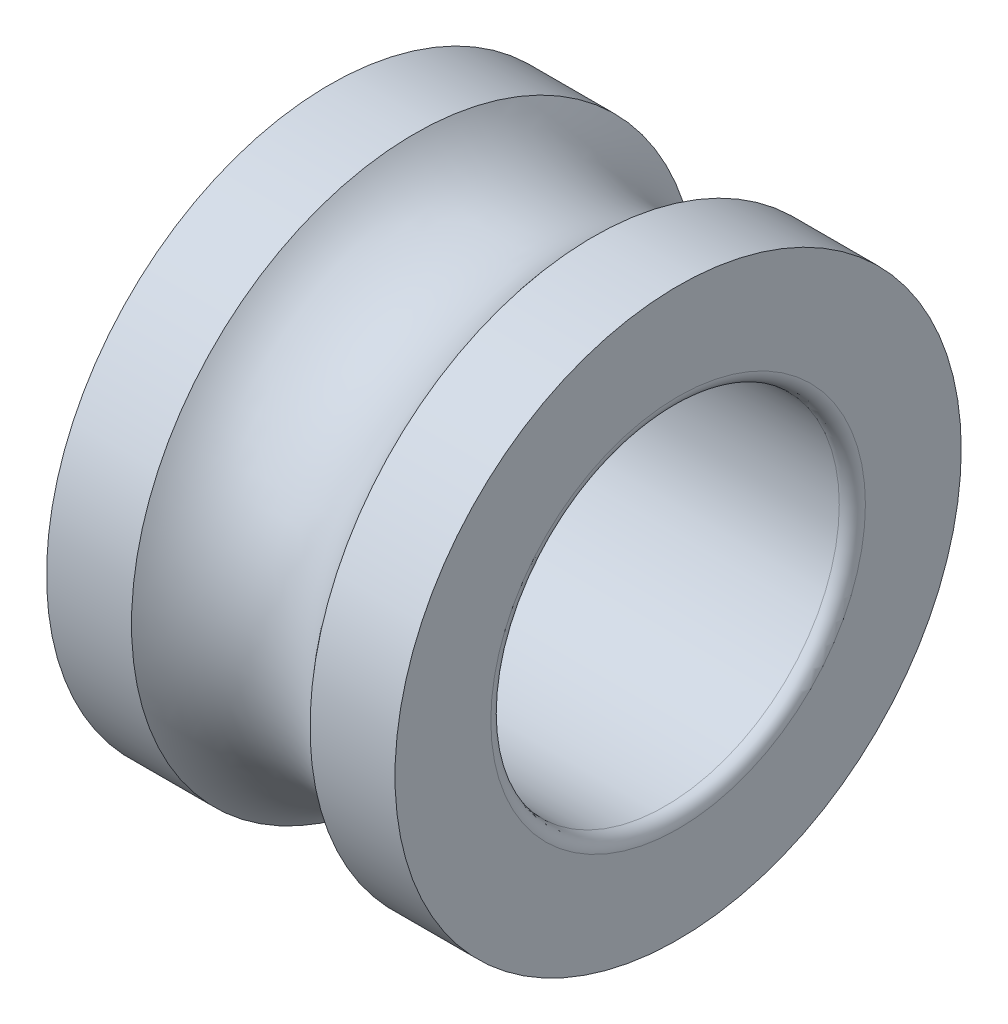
ISO-10303-21;
HEADER;
FILE_DESCRIPTION(('STEP AP214'),'2;1');
FILE_NAME('part.step','',(''),(''),'','','');
FILE_SCHEMA(('AUTOMOTIVE_DESIGN { 1 0 10303 214 1 1 1 1 }'));
ENDSEC;
DATA;
#1=APPLICATION_CONTEXT('core data for automotive mechanical design processes');
#2=APPLICATION_PROTOCOL_DEFINITION('international standard','automotive_design',2000,#1);
#3=PRODUCT_CONTEXT('',#1,'mechanical');
#4=PRODUCT('Part','Part','',(#3));
#5=PRODUCT_RELATED_PRODUCT_CATEGORY('part','',(#4));
#6=PRODUCT_DEFINITION_FORMATION('','',#4);
#7=PRODUCT_DEFINITION_CONTEXT('part definition',#1,'design');
#8=PRODUCT_DEFINITION('design','',#6,#7);
#9=PRODUCT_DEFINITION_SHAPE('','',#8);
#10=(LENGTH_UNIT() NAMED_UNIT(*) SI_UNIT(.MILLI.,.METRE.));
#11=(NAMED_UNIT(*) PLANE_ANGLE_UNIT() SI_UNIT($,.RADIAN.));
#12=(NAMED_UNIT(*) SI_UNIT($,.STERADIAN.) SOLID_ANGLE_UNIT());
#13=UNCERTAINTY_MEASURE_WITH_UNIT(LENGTH_MEASURE(1.E-05),#10,'distance_accuracy_value','');
#14=(GEOMETRIC_REPRESENTATION_CONTEXT(3) GLOBAL_UNCERTAINTY_ASSIGNED_CONTEXT((#13)) GLOBAL_UNIT_ASSIGNED_CONTEXT((#10,
#11,#12)) REPRESENTATION_CONTEXT('',''));
#15=CARTESIAN_POINT('',(0.,0.,0.));
#16=DIRECTION('',(0.,0.,1.));
#17=DIRECTION('',(1.,0.,0.));
#18=AXIS2_PLACEMENT_3D('',#15,#16,#17);
#19=CARTESIAN_POINT('',(-4.,6.5,0.));
#20=DIRECTION('',(-1.,0.,0.));
#21=DIRECTION('',(0.,0.,1.));
#22=AXIS2_PLACEMENT_3D('',#19,#20,#21);
#23=PLANE('',#22);
#24=CARTESIAN_POINT('',(-4.,0.,0.));
#25=DIRECTION('',(1.,0.,0.));
#26=DIRECTION('',(0.,0.,-1.));
#27=AXIS2_PLACEMENT_3D('',#24,#25,#26);
#28=CIRCLE('',#27,4.30000003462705);
#29=CARTESIAN_POINT('',(-4.,0.,-4.30000003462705));
#30=VERTEX_POINT('',#29);
#31=EDGE_CURVE('E5',#30,#30,#28,.T.);
#32=ORIENTED_EDGE('',*,*,#31,.T.);
#33=EDGE_LOOP('',(#32));
#34=FACE_BOUND('',#33,.T.);
#35=CARTESIAN_POINT('',(-4.,0.,0.));
#36=DIRECTION('',(1.,0.,0.));
#37=DIRECTION('',(0.,0.,-1.));
#38=AXIS2_PLACEMENT_3D('',#35,#36,#37);
#39=CIRCLE('',#38,6.5);
#40=CARTESIAN_POINT('',(-4.,0.,-6.5));
#41=VERTEX_POINT('',#40);
#42=EDGE_CURVE('E9',#41,#41,#39,.T.);
#43=ORIENTED_EDGE('',*,*,#42,.F.);
#44=EDGE_LOOP('',(#43));
#45=FACE_BOUND('',#44,.T.);
#46=ADVANCED_FACE('F13',(#34,#45),#23,.T.);
#47=CARTESIAN_POINT('',(-3.70000000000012,0.,0.));
#48=DIRECTION('',(1.,0.,0.));
#49=DIRECTION('',(0.,0.,-1.));
#50=AXIS2_PLACEMENT_3D('',#47,#48,#49);
#51=TOROIDAL_SURFACE('',#50,4.29999999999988,0.299999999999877);
#52=CARTESIAN_POINT('',(-3.7,0.,0.));
#53=DIRECTION('',(1.,0.,0.));
#54=DIRECTION('',(0.,0.,-1.));
#55=AXIS2_PLACEMENT_3D('',#52,#53,#54);
#56=CIRCLE('',#55,4.);
#57=CARTESIAN_POINT('',(-3.7,0.,-4.));
#58=VERTEX_POINT('',#57);
#59=EDGE_CURVE('E24',#58,#58,#56,.T.);
#60=ORIENTED_EDGE('',*,*,#59,.T.);
#61=EDGE_LOOP('',(#60));
#62=FACE_BOUND('',#61,.T.);
#63=ORIENTED_EDGE('',*,*,#31,.F.);
#64=EDGE_LOOP('',(#63));
#65=FACE_BOUND('',#64,.T.);
#66=ADVANCED_FACE('F30',(#62,#65),#51,.T.);
#67=CARTESIAN_POINT('',(4.,0.,0.));
#68=DIRECTION('',(1.,0.,0.));
#69=DIRECTION('',(0.,0.,-1.));
#70=AXIS2_PLACEMENT_3D('',#67,#68,#69);
#71=CYLINDRICAL_SURFACE('',#70,6.5);
#72=ORIENTED_EDGE('',*,*,#42,.T.);
#73=EDGE_LOOP('',(#72));
#74=FACE_BOUND('',#73,.T.);
#75=CARTESIAN_POINT('',(-2.0493901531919,0.,0.));
#76=DIRECTION('',(1.,0.,0.));
#77=DIRECTION('',(0.,0.,-1.));
#78=AXIS2_PLACEMENT_3D('',#75,#76,#77);
#79=CIRCLE('',#78,6.5);
#80=CARTESIAN_POINT('',(-2.0493901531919,0.,-6.5));
#81=VERTEX_POINT('',#80);
#82=EDGE_CURVE('E39',#81,#81,#79,.T.);
#83=ORIENTED_EDGE('',*,*,#82,.F.);
#84=EDGE_LOOP('',(#83));
#85=FACE_BOUND('',#84,.T.);
#86=ADVANCED_FACE('F43',(#74,#85),#71,.T.);
#87=CARTESIAN_POINT('',(4.,0.,0.));
#88=DIRECTION('',(1.,0.,0.));
#89=DIRECTION('',(0.,0.,-1.));
#90=AXIS2_PLACEMENT_3D('',#87,#88,#89);
#91=CYLINDRICAL_SURFACE('',#90,4.);
#92=CARTESIAN_POINT('',(3.7,0.,0.));
#93=DIRECTION('',(1.,0.,0.));
#94=DIRECTION('',(0.,0.,-1.));
#95=AXIS2_PLACEMENT_3D('',#92,#93,#94);
#96=CIRCLE('',#95,4.);
#97=CARTESIAN_POINT('',(3.7,0.,-4.));
#98=VERTEX_POINT('',#97);
#99=EDGE_CURVE('E50',#98,#98,#96,.T.);
#100=ORIENTED_EDGE('',*,*,#99,.T.);
#101=EDGE_LOOP('',(#100));
#102=FACE_BOUND('',#101,.T.);
#103=ORIENTED_EDGE('',*,*,#59,.F.);
#104=EDGE_LOOP('',(#103));
#105=FACE_BOUND('',#104,.T.);
#106=ADVANCED_FACE('F56',(#102,#105),#91,.F.);
#107=CARTESIAN_POINT('',(0.,0.,0.));
#108=DIRECTION('',(1.,0.,0.));
#109=DIRECTION('',(0.,0.,-1.));
#110=AXIS2_PLACEMENT_3D('',#107,#108,#109);
#111=TOROIDAL_SURFACE('',#110,8.1,2.59999999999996);
#112=CARTESIAN_POINT('',(2.0493901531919,0.,0.));
#113=DIRECTION('',(1.,0.,0.));
#114=DIRECTION('',(0.,0.,-1.));
#115=AXIS2_PLACEMENT_3D('',#112,#113,#114);
#116=CIRCLE('',#115,6.5);
#117=CARTESIAN_POINT('',(2.0493901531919,0.,-6.5));
#118=VERTEX_POINT('',#117);
#119=EDGE_CURVE('E63',#118,#118,#116,.T.);
#120=ORIENTED_EDGE('',*,*,#119,.F.);
#121=EDGE_LOOP('',(#120));
#122=FACE_BOUND('',#121,.T.);
#123=ORIENTED_EDGE('',*,*,#82,.T.);
#124=EDGE_LOOP('',(#123));
#125=FACE_BOUND('',#124,.T.);
#126=ADVANCED_FACE('F69',(#122,#125),#111,.F.);
#127=CARTESIAN_POINT('',(3.70000000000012,0.,0.));
#128=DIRECTION('',(1.,0.,0.));
#129=DIRECTION('',(0.,0.,-1.));
#130=AXIS2_PLACEMENT_3D('',#127,#128,#129);
#131=TOROIDAL_SURFACE('',#130,4.29999999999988,0.299999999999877);
#132=CARTESIAN_POINT('',(4.,0.,0.));
#133=DIRECTION('',(1.,0.,0.));
#134=DIRECTION('',(0.,0.,-1.));
#135=AXIS2_PLACEMENT_3D('',#132,#133,#134);
#136=CIRCLE('',#135,4.30000003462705);
#137=CARTESIAN_POINT('',(4.,0.,-4.30000003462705));
#138=VERTEX_POINT('',#137);
#139=EDGE_CURVE('E76',#138,#138,#136,.T.);
#140=ORIENTED_EDGE('',*,*,#139,.T.);
#141=EDGE_LOOP('',(#140));
#142=FACE_BOUND('',#141,.T.);
#143=ORIENTED_EDGE('',*,*,#99,.F.);
#144=EDGE_LOOP('',(#143));
#145=FACE_BOUND('',#144,.T.);
#146=ADVANCED_FACE('F82',(#142,#145),#131,.T.);
#147=CARTESIAN_POINT('',(4.,0.,0.));
#148=DIRECTION('',(1.,0.,0.));
#149=DIRECTION('',(0.,0.,-1.));
#150=AXIS2_PLACEMENT_3D('',#147,#148,#149);
#151=CYLINDRICAL_SURFACE('',#150,6.5);
#152=ORIENTED_EDGE('',*,*,#119,.T.);
#153=EDGE_LOOP('',(#152));
#154=FACE_BOUND('',#153,.T.);
#155=CARTESIAN_POINT('',(4.,0.,0.));
#156=DIRECTION('',(1.,0.,0.));
#157=DIRECTION('',(0.,0.,-1.));
#158=AXIS2_PLACEMENT_3D('',#155,#156,#157);
#159=CIRCLE('',#158,6.5);
#160=CARTESIAN_POINT('',(4.,0.,-6.5));
#161=VERTEX_POINT('',#160);
#162=EDGE_CURVE('E91',#161,#161,#159,.T.);
#163=ORIENTED_EDGE('',*,*,#162,.F.);
#164=EDGE_LOOP('',(#163));
#165=FACE_BOUND('',#164,.T.);
#166=ADVANCED_FACE('F95',(#154,#165),#151,.T.);
#167=CARTESIAN_POINT('',(4.,4.3,0.));
#168=DIRECTION('',(1.,0.,0.));
#169=DIRECTION('',(0.,0.,-1.));
#170=AXIS2_PLACEMENT_3D('',#167,#168,#169);
#171=PLANE('',#170);
#172=ORIENTED_EDGE('',*,*,#162,.T.);
#173=EDGE_LOOP('',(#172));
#174=FACE_BOUND('',#173,.T.);
#175=ORIENTED_EDGE('',*,*,#139,.F.);
#176=EDGE_LOOP('',(#175));
#177=FACE_BOUND('',#176,.T.);
#178=ADVANCED_FACE('F106',(#174,#177),#171,.T.);
#179=CLOSED_SHELL('',(#46,#66,#86,#106,#126,#146,#166,#178));
#180=MANIFOLD_SOLID_BREP('B1',#179);
#181=ADVANCED_BREP_SHAPE_REPRESENTATION('',(#18,#180),#14);
#182=SHAPE_DEFINITION_REPRESENTATION(#9,#181);
ENDSEC;
END-ISO-10303-21;
